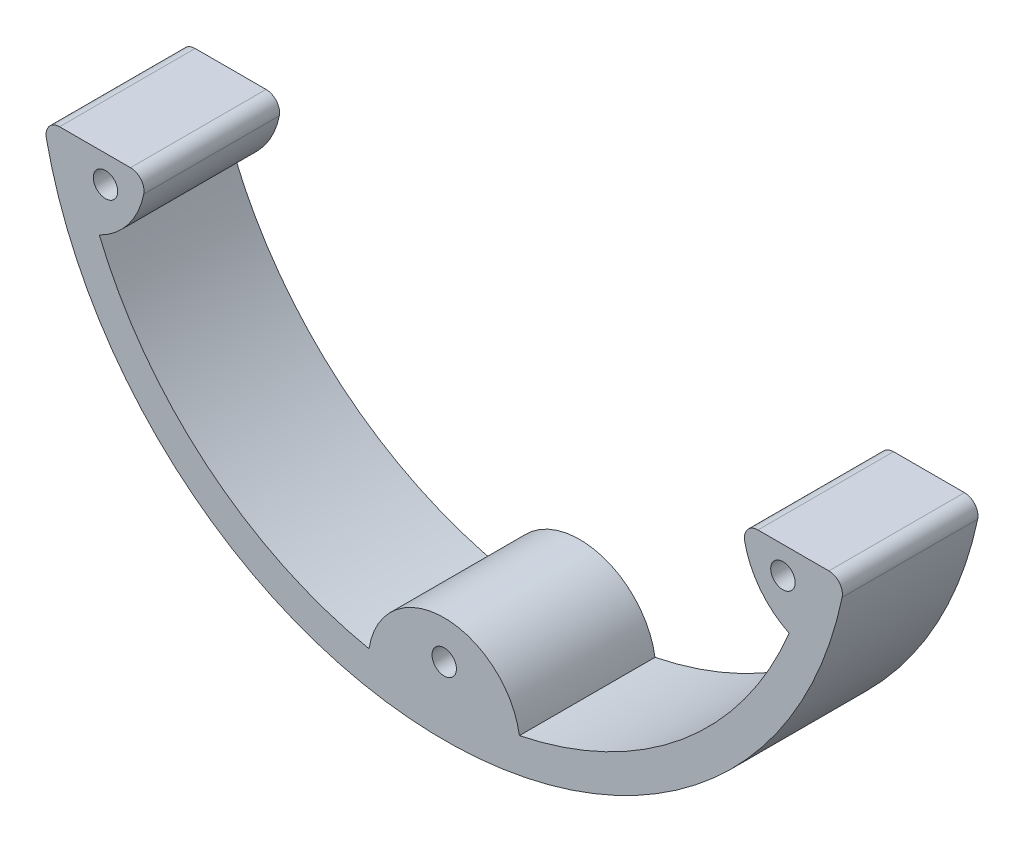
ISO-10303-21;
HEADER;
FILE_DESCRIPTION(('STEP AP214'),'2;1');
FILE_NAME('part.step','',(''),(''),'','','');
FILE_SCHEMA(('AUTOMOTIVE_DESIGN { 1 0 10303 214 1 1 1 1 }'));
ENDSEC;
DATA;
#1=APPLICATION_CONTEXT('core data for automotive mechanical design processes');
#2=APPLICATION_PROTOCOL_DEFINITION('international standard','automotive_design',2000,#1);
#3=PRODUCT_CONTEXT('',#1,'mechanical');
#4=PRODUCT('Part','Part','',(#3));
#5=PRODUCT_RELATED_PRODUCT_CATEGORY('part','',(#4));
#6=PRODUCT_DEFINITION_FORMATION('','',#4);
#7=PRODUCT_DEFINITION_CONTEXT('part definition',#1,'design');
#8=PRODUCT_DEFINITION('design','',#6,#7);
#9=PRODUCT_DEFINITION_SHAPE('','',#8);
#10=(LENGTH_UNIT() NAMED_UNIT(*) SI_UNIT(.MILLI.,.METRE.));
#11=(NAMED_UNIT(*) PLANE_ANGLE_UNIT() SI_UNIT($,.RADIAN.));
#12=(NAMED_UNIT(*) SI_UNIT($,.STERADIAN.) SOLID_ANGLE_UNIT());
#13=UNCERTAINTY_MEASURE_WITH_UNIT(LENGTH_MEASURE(1.E-05),#10,'distance_accuracy_value','');
#14=(GEOMETRIC_REPRESENTATION_CONTEXT(3) GLOBAL_UNCERTAINTY_ASSIGNED_CONTEXT((#13)) GLOBAL_UNIT_ASSIGNED_CONTEXT((#10,
#11,#12)) REPRESENTATION_CONTEXT('',''));
#15=CARTESIAN_POINT('',(0.,0.,0.));
#16=DIRECTION('',(0.,0.,1.));
#17=DIRECTION('',(1.,0.,0.));
#18=AXIS2_PLACEMENT_3D('',#15,#16,#17);
#19=CARTESIAN_POINT('',(0.,0.,120.));
#20=DIRECTION('',(0.,0.,1.));
#21=DIRECTION('',(1.,0.,0.));
#22=AXIS2_PLACEMENT_3D('',#19,#20,#21);
#23=PLANE('',#22);
#24=CARTESIAN_POINT('',(0.164108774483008,-105.,120.));
#25=DIRECTION('',(0.,0.,1.));
#26=DIRECTION('',(1.,0.,0.));
#27=AXIS2_PLACEMENT_3D('',#24,#25,#26);
#28=CIRCLE('',#27,1.8);
#29=CARTESIAN_POINT('',(1.96410877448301,-105.,120.));
#30=VERTEX_POINT('',#29);
#31=EDGE_CURVE('E51',#30,#30,#28,.T.);
#32=ORIENTED_EDGE('',*,*,#31,.T.);
#33=EDGE_LOOP('',(#32));
#34=FACE_BOUND('',#33,.T.);
#35=CARTESIAN_POINT('',(50.1274267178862,-69.,120.));
#36=DIRECTION('',(0.,0.,1.));
#37=DIRECTION('',(1.,0.,0.));
#38=AXIS2_PLACEMENT_3D('',#35,#36,#37);
#39=CIRCLE('',#38,1.8);
#40=CARTESIAN_POINT('',(51.9274267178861,-69.,120.));
#41=VERTEX_POINT('',#40);
#42=EDGE_CURVE('E238',#41,#41,#39,.T.);
#43=ORIENTED_EDGE('',*,*,#42,.T.);
#44=EDGE_LOOP('',(#43));
#45=FACE_BOUND('',#44,.T.);
#46=CARTESIAN_POINT('',(-49.7992091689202,-69.,120.));
#47=DIRECTION('',(0.,0.,1.));
#48=DIRECTION('',(1.,0.,0.));
#49=AXIS2_PLACEMENT_3D('',#46,#47,#48);
#50=CIRCLE('',#49,1.8);
#51=CARTESIAN_POINT('',(-47.9992091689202,-69.,120.));
#52=VERTEX_POINT('',#51);
#53=EDGE_CURVE('E236',#52,#52,#50,.T.);
#54=ORIENTED_EDGE('',*,*,#53,.T.);
#55=EDGE_LOOP('',(#54));
#56=FACE_BOUND('',#55,.T.);
#57=CARTESIAN_POINT('',(0.164108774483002,-55.,120.));
#58=DIRECTION('',(0.,0.,1.));
#59=DIRECTION('',(1.,0.,0.));
#60=AXIS2_PLACEMENT_3D('',#57,#58,#59);
#61=CIRCLE('',#60,60.);
#62=CARTESIAN_POINT('',(58.86587826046,-67.4137931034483,120.));
#63=VERTEX_POINT('',#62);
#64=CARTESIAN_POINT('',(-58.537660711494,-67.4137931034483,120.));
#65=VERTEX_POINT('',#64);
#66=EDGE_CURVE('E234',#63,#65,#61,.F.);
#67=ORIENTED_EDGE('',*,*,#66,.T.);
#68=CARTESIAN_POINT('',(-56.5809350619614,-67.,120.));
#69=DIRECTION('',(0.,0.,1.));
#70=DIRECTION('',(1.,0.,0.));
#71=AXIS2_PLACEMENT_3D('',#68,#69,#70);
#72=CIRCLE('',#71,2.);
#73=CARTESIAN_POINT('',(-56.5809350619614,-65.,120.));
#74=VERTEX_POINT('',#73);
#75=EDGE_CURVE('E72',#65,#74,#72,.F.);
#76=ORIENTED_EDGE('',*,*,#75,.T.);
#77=DIRECTION('',(-1.,0.,0.));
#78=VECTOR('',#77,1.);
#79=CARTESIAN_POINT('',(-58.9966890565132,-65.,120.));
#80=LINE('',#79,#78);
#81=CARTESIAN_POINT('',(-46.1184016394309,-65.,120.));
#82=VERTEX_POINT('',#81);
#83=EDGE_CURVE('E176',#82,#74,#80,.T.);
#84=ORIENTED_EDGE('',*,*,#83,.F.);
#85=CARTESIAN_POINT('',(-46.1184016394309,-67.,120.));
#86=DIRECTION('',(0.,0.,1.));
#87=DIRECTION('',(1.,0.,0.));
#88=AXIS2_PLACEMENT_3D('',#85,#86,#87);
#89=CIRCLE('',#88,2.);
#90=CARTESIAN_POINT('',(-44.1577086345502,-67.3945667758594,120.));
#91=VERTEX_POINT('',#90);
#92=EDGE_CURVE('E56',#82,#91,#89,.F.);
#93=ORIENTED_EDGE('',*,*,#92,.T.);
#94=CARTESIAN_POINT('',(-56.0568613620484,-65.,120.));
#95=DIRECTION('',(0.,0.,1.));
#96=DIRECTION('',(-1.,0.,0.));
#97=AXIS2_PLACEMENT_3D('',#94,#95,#96);
#98=CIRCLE('',#97,12.1377010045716);
#99=CARTESIAN_POINT('',(-50.7113017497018,-75.897191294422,120.));
#100=VERTEX_POINT('',#99);
#101=EDGE_CURVE('E174',#100,#91,#98,.T.);
#102=ORIENTED_EDGE('',*,*,#101,.F.);
#103=CARTESIAN_POINT('',(0.164108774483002,-55.,120.));
#104=DIRECTION('',(0.,0.,-1.));
#105=DIRECTION('',(1.,0.,0.));
#106=AXIS2_PLACEMENT_3D('',#103,#104,#105);
#107=CIRCLE('',#106,55.);
#108=CARTESIAN_POINT('',(-10.9303499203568,-108.869406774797,120.));
#109=VERTEX_POINT('',#108);
#110=EDGE_CURVE('E186',#109,#100,#107,.T.);
#111=ORIENTED_EDGE('',*,*,#110,.F.);
#112=CARTESIAN_POINT('',(0.164108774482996,-110.583326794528,120.));
#113=DIRECTION('',(0.,0.,1.));
#114=DIRECTION('',(-1.,0.,0.));
#115=AXIS2_PLACEMENT_3D('',#112,#113,#114);
#116=CIRCLE('',#115,11.2260650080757);
#117=CARTESIAN_POINT('',(11.2585674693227,-108.869406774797,120.));
#118=VERTEX_POINT('',#117);
#119=EDGE_CURVE('E184',#118,#109,#116,.T.);
#120=ORIENTED_EDGE('',*,*,#119,.F.);
#121=CARTESIAN_POINT('',(0.164108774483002,-55.,120.));
#122=DIRECTION('',(0.,0.,-1.));
#123=DIRECTION('',(1.,0.,0.));
#124=AXIS2_PLACEMENT_3D('',#121,#122,#123);
#125=CIRCLE('',#124,55.);
#126=CARTESIAN_POINT('',(51.0395192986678,-75.897191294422,120.));
#127=VERTEX_POINT('',#126);
#128=EDGE_CURVE('E182',#127,#118,#125,.T.);
#129=ORIENTED_EDGE('',*,*,#128,.F.);
#130=CARTESIAN_POINT('',(56.3850789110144,-65.,120.));
#131=DIRECTION('',(0.,0.,1.));
#132=DIRECTION('',(1.,0.,0.));
#133=AXIS2_PLACEMENT_3D('',#130,#131,#132);
#134=CIRCLE('',#133,12.1377010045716);
#135=CARTESIAN_POINT('',(44.4859261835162,-67.3945667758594,120.));
#136=VERTEX_POINT('',#135);
#137=EDGE_CURVE('E157',#136,#127,#134,.T.);
#138=ORIENTED_EDGE('',*,*,#137,.F.);
#139=CARTESIAN_POINT('',(46.4466191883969,-67.,120.));
#140=DIRECTION('',(0.,0.,1.));
#141=DIRECTION('',(1.,0.,0.));
#142=AXIS2_PLACEMENT_3D('',#139,#140,#141);
#143=CIRCLE('',#142,2.);
#144=CARTESIAN_POINT('',(46.4466191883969,-65.,120.));
#145=VERTEX_POINT('',#144);
#146=EDGE_CURVE('E12',#136,#145,#143,.F.);
#147=ORIENTED_EDGE('',*,*,#146,.T.);
#148=DIRECTION('',(-1.,0.,0.));
#149=VECTOR('',#148,1.);
#150=CARTESIAN_POINT('',(54.2473779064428,-65.,120.));
#151=LINE('',#150,#149);
#152=CARTESIAN_POINT('',(56.9091526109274,-65.,120.));
#153=VERTEX_POINT('',#152);
#154=EDGE_CURVE('E179',#153,#145,#151,.T.);
#155=ORIENTED_EDGE('',*,*,#154,.F.);
#156=CARTESIAN_POINT('',(56.9091526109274,-67.,120.));
#157=DIRECTION('',(0.,0.,1.));
#158=DIRECTION('',(1.,0.,0.));
#159=AXIS2_PLACEMENT_3D('',#156,#157,#158);
#160=CIRCLE('',#159,2.);
#161=EDGE_CURVE('E64',#153,#63,#160,.F.);
#162=ORIENTED_EDGE('',*,*,#161,.T.);
#163=EDGE_LOOP('',(#67,#76,#84,#93,#102,#111,#120,#129,#138,#147,#155,#162));
#164=FACE_BOUND('',#163,.T.);
#165=ADVANCED_FACE('F48',(#34,#45,#56,#164),#23,.F.);
#166=CARTESIAN_POINT('',(0.164108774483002,-55.,140.));
#167=DIRECTION('',(0.,0.,-1.));
#168=DIRECTION('',(-1.,0.,0.));
#169=AXIS2_PLACEMENT_3D('',#166,#167,#168);
#170=CYLINDRICAL_SURFACE('',#169,55.);
#171=ORIENTED_EDGE('',*,*,#128,.T.);
#172=DIRECTION('',(0.,0.,-1.));
#173=VECTOR('',#172,1.);
#174=CARTESIAN_POINT('',(11.2585674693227,-108.869406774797,140.));
#175=LINE('',#174,#173);
#176=CARTESIAN_POINT('',(11.2585674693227,-108.869406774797,140.));
#177=VERTEX_POINT('',#176);
#178=EDGE_CURVE('E161',#177,#118,#175,.T.);
#179=ORIENTED_EDGE('',*,*,#178,.F.);
#180=CARTESIAN_POINT('',(0.164108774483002,-55.,140.));
#181=DIRECTION('',(0.,0.,-1.));
#182=DIRECTION('',(1.,0.,0.));
#183=AXIS2_PLACEMENT_3D('',#180,#181,#182);
#184=CIRCLE('',#183,55.);
#185=CARTESIAN_POINT('',(51.0395192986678,-75.897191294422,140.));
#186=VERTEX_POINT('',#185);
#187=EDGE_CURVE('E144',#186,#177,#184,.T.);
#188=ORIENTED_EDGE('',*,*,#187,.F.);
#189=DIRECTION('',(0.,0.,-1.));
#190=VECTOR('',#189,1.);
#191=CARTESIAN_POINT('',(51.0395192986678,-75.897191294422,140.));
#192=LINE('',#191,#190);
#193=EDGE_CURVE('E154',#186,#127,#192,.T.);
#194=ORIENTED_EDGE('',*,*,#193,.T.);
#195=EDGE_LOOP('',(#171,#179,#188,#194));
#196=FACE_BOUND('',#195,.T.);
#197=ADVANCED_FACE('F163',(#196),#170,.F.);
#198=CARTESIAN_POINT('',(0.164108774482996,-110.583326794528,140.));
#199=DIRECTION('',(0.,0.,-1.));
#200=DIRECTION('',(-1.,0.,0.));
#201=AXIS2_PLACEMENT_3D('',#198,#199,#200);
#202=CYLINDRICAL_SURFACE('',#201,11.2260650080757);
#203=ORIENTED_EDGE('',*,*,#119,.T.);
#204=DIRECTION('',(0.,0.,-1.));
#205=VECTOR('',#204,1.);
#206=CARTESIAN_POINT('',(-10.9303499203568,-108.869406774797,140.));
#207=LINE('',#206,#205);
#208=CARTESIAN_POINT('',(-10.9303499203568,-108.869406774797,140.));
#209=VERTEX_POINT('',#208);
#210=EDGE_CURVE('E191',#209,#109,#207,.T.);
#211=ORIENTED_EDGE('',*,*,#210,.F.);
#212=CARTESIAN_POINT('',(0.164108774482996,-110.583326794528,140.));
#213=DIRECTION('',(0.,0.,1.));
#214=DIRECTION('',(-1.,0.,0.));
#215=AXIS2_PLACEMENT_3D('',#212,#213,#214);
#216=CIRCLE('',#215,11.2260650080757);
#217=EDGE_CURVE('E166',#177,#209,#216,.T.);
#218=ORIENTED_EDGE('',*,*,#217,.F.);
#219=ORIENTED_EDGE('',*,*,#178,.T.);
#220=EDGE_LOOP('',(#203,#211,#218,#219));
#221=FACE_BOUND('',#220,.T.);
#222=ADVANCED_FACE('F273',(#221),#202,.T.);
#223=CARTESIAN_POINT('',(56.3850789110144,-65.,140.));
#224=DIRECTION('',(0.,0.,-1.));
#225=DIRECTION('',(-1.,0.,0.));
#226=AXIS2_PLACEMENT_3D('',#223,#224,#225);
#227=CYLINDRICAL_SURFACE('',#226,12.1377010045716);
#228=CARTESIAN_POINT('',(56.3850789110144,-65.,140.));
#229=DIRECTION('',(0.,0.,1.));
#230=DIRECTION('',(1.,0.,0.));
#231=AXIS2_PLACEMENT_3D('',#228,#229,#230);
#232=CIRCLE('',#231,12.1377010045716);
#233=CARTESIAN_POINT('',(44.4859261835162,-67.3945667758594,140.));
#234=VERTEX_POINT('',#233);
#235=EDGE_CURVE('E139',#234,#186,#232,.T.);
#236=ORIENTED_EDGE('',*,*,#235,.F.);
#237=DIRECTION('',(0.,0.,-1.));
#238=VECTOR('',#237,1.);
#239=CARTESIAN_POINT('',(44.4859261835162,-67.3945667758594,140.));
#240=LINE('',#239,#238);
#241=EDGE_CURVE('E160',#234,#136,#240,.T.);
#242=ORIENTED_EDGE('',*,*,#241,.T.);
#243=ORIENTED_EDGE('',*,*,#137,.T.);
#244=ORIENTED_EDGE('',*,*,#193,.F.);
#245=EDGE_LOOP('',(#236,#242,#243,#244));
#246=FACE_BOUND('',#245,.T.);
#247=ADVANCED_FACE('F155',(#246),#227,.T.);
#248=CARTESIAN_POINT('',(-56.0568613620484,-65.,140.));
#249=DIRECTION('',(0.,0.,-1.));
#250=DIRECTION('',(-1.,0.,0.));
#251=AXIS2_PLACEMENT_3D('',#248,#249,#250);
#252=CYLINDRICAL_SURFACE('',#251,12.1377010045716);
#253=ORIENTED_EDGE('',*,*,#101,.T.);
#254=DIRECTION('',(0.,0.,-1.));
#255=VECTOR('',#254,1.);
#256=CARTESIAN_POINT('',(-44.1577086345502,-67.3945667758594,140.));
#257=LINE('',#256,#255);
#258=CARTESIAN_POINT('',(-44.1577086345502,-67.3945667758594,140.));
#259=VERTEX_POINT('',#258);
#260=EDGE_CURVE('E213',#91,#259,#257,.F.);
#261=ORIENTED_EDGE('',*,*,#260,.T.);
#262=CARTESIAN_POINT('',(-56.0568613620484,-65.,140.));
#263=DIRECTION('',(0.,0.,1.));
#264=DIRECTION('',(-1.,0.,0.));
#265=AXIS2_PLACEMENT_3D('',#262,#263,#264);
#266=CIRCLE('',#265,12.1377010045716);
#267=CARTESIAN_POINT('',(-50.7113017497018,-75.897191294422,140.));
#268=VERTEX_POINT('',#267);
#269=EDGE_CURVE('E188',#268,#259,#266,.T.);
#270=ORIENTED_EDGE('',*,*,#269,.F.);
#271=DIRECTION('',(0.,0.,-1.));
#272=VECTOR('',#271,1.);
#273=CARTESIAN_POINT('',(-50.7113017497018,-75.897191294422,140.));
#274=LINE('',#273,#272);
#275=EDGE_CURVE('E173',#268,#100,#274,.T.);
#276=ORIENTED_EDGE('',*,*,#275,.T.);
#277=EDGE_LOOP('',(#253,#261,#270,#276));
#278=FACE_BOUND('',#277,.T.);
#279=ADVANCED_FACE('F283',(#278),#252,.T.);
#280=CARTESIAN_POINT('',(54.2473779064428,-65.,140.));
#281=DIRECTION('',(0.,-1.,0.));
#282=DIRECTION('',(0.,0.,-1.));
#283=AXIS2_PLACEMENT_3D('',#280,#281,#282);
#284=PLANE('',#283);
#285=DIRECTION('',(-1.,0.,0.));
#286=VECTOR('',#285,1.);
#287=CARTESIAN_POINT('',(54.2473779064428,-65.,140.));
#288=LINE('',#287,#286);
#289=CARTESIAN_POINT('',(56.9091526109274,-65.,140.));
#290=VERTEX_POINT('',#289);
#291=CARTESIAN_POINT('',(46.4466191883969,-65.,140.));
#292=VERTEX_POINT('',#291);
#293=EDGE_CURVE('E151',#290,#292,#288,.T.);
#294=ORIENTED_EDGE('',*,*,#293,.F.);
#295=DIRECTION('',(0.,0.,-1.));
#296=VECTOR('',#295,1.);
#297=CARTESIAN_POINT('',(56.9091526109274,-65.,120.));
#298=LINE('',#297,#296);
#299=EDGE_CURVE('E214',#290,#153,#298,.T.);
#300=ORIENTED_EDGE('',*,*,#299,.T.);
#301=ORIENTED_EDGE('',*,*,#154,.T.);
#302=DIRECTION('',(0.,0.,-1.));
#303=VECTOR('',#302,1.);
#304=CARTESIAN_POINT('',(46.4466191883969,-65.,140.));
#305=LINE('',#304,#303);
#306=EDGE_CURVE('E204',#145,#292,#305,.F.);
#307=ORIENTED_EDGE('',*,*,#306,.T.);
#308=EDGE_LOOP('',(#294,#300,#301,#307));
#309=FACE_BOUND('',#308,.T.);
#310=ADVANCED_FACE('F284',(#309),#284,.F.);
#311=CARTESIAN_POINT('',(0.164108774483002,-55.,110.));
#312=DIRECTION('',(0.,0.,1.));
#313=DIRECTION('',(1.,0.,0.));
#314=AXIS2_PLACEMENT_3D('',#311,#312,#313);
#315=CYLINDRICAL_SURFACE('',#314,60.);
#316=ORIENTED_EDGE('',*,*,#66,.F.);
#317=DIRECTION('',(0.,0.,1.));
#318=VECTOR('',#317,1.);
#319=CARTESIAN_POINT('',(58.86587826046,-67.4137931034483,110.));
#320=LINE('',#319,#318);
#321=CARTESIAN_POINT('',(58.86587826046,-67.4137931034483,140.));
#322=VERTEX_POINT('',#321);
#323=EDGE_CURVE('E220',#63,#322,#320,.T.);
#324=ORIENTED_EDGE('',*,*,#323,.T.);
#325=CARTESIAN_POINT('',(0.164108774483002,-55.,140.));
#326=DIRECTION('',(0.,0.,1.));
#327=DIRECTION('',(1.,0.,0.));
#328=AXIS2_PLACEMENT_3D('',#325,#326,#327);
#329=CIRCLE('',#328,60.);
#330=CARTESIAN_POINT('',(-58.537660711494,-67.4137931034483,140.));
#331=VERTEX_POINT('',#330);
#332=EDGE_CURVE('E312',#331,#322,#329,.T.);
#333=ORIENTED_EDGE('',*,*,#332,.F.);
#334=DIRECTION('',(0.,0.,1.));
#335=VECTOR('',#334,1.);
#336=CARTESIAN_POINT('',(-58.537660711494,-67.4137931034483,110.));
#337=LINE('',#336,#335);
#338=EDGE_CURVE('E225',#331,#65,#337,.F.);
#339=ORIENTED_EDGE('',*,*,#338,.T.);
#340=EDGE_LOOP('',(#316,#324,#333,#339));
#341=FACE_BOUND('',#340,.T.);
#342=ADVANCED_FACE('F263',(#341),#315,.T.);
#343=CARTESIAN_POINT('',(-58.9966890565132,-65.,140.));
#344=DIRECTION('',(0.,-1.,0.));
#345=DIRECTION('',(0.,0.,-1.));
#346=AXIS2_PLACEMENT_3D('',#343,#344,#345);
#347=PLANE('',#346);
#348=ORIENTED_EDGE('',*,*,#83,.T.);
#349=DIRECTION('',(0.,0.,-1.));
#350=VECTOR('',#349,1.);
#351=CARTESIAN_POINT('',(-56.5809350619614,-65.,140.));
#352=LINE('',#351,#350);
#353=CARTESIAN_POINT('',(-56.5809350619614,-65.,140.));
#354=VERTEX_POINT('',#353);
#355=EDGE_CURVE('E229',#74,#354,#352,.F.);
#356=ORIENTED_EDGE('',*,*,#355,.T.);
#357=DIRECTION('',(-1.,0.,0.));
#358=VECTOR('',#357,1.);
#359=CARTESIAN_POINT('',(-53.9191603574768,-65.,140.));
#360=LINE('',#359,#358);
#361=CARTESIAN_POINT('',(-46.1184016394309,-65.,140.));
#362=VERTEX_POINT('',#361);
#363=EDGE_CURVE('E314',#362,#354,#360,.T.);
#364=ORIENTED_EDGE('',*,*,#363,.F.);
#365=DIRECTION('',(0.,0.,-1.));
#366=VECTOR('',#365,1.);
#367=CARTESIAN_POINT('',(-46.1184016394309,-65.,140.));
#368=LINE('',#367,#366);
#369=EDGE_CURVE('E210',#362,#82,#368,.T.);
#370=ORIENTED_EDGE('',*,*,#369,.T.);
#371=EDGE_LOOP('',(#348,#356,#364,#370));
#372=FACE_BOUND('',#371,.T.);
#373=ADVANCED_FACE('F255',(#372),#347,.F.);
#374=CARTESIAN_POINT('',(-56.0568613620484,-65.,140.));
#375=DIRECTION('',(0.,0.,-1.));
#376=DIRECTION('',(-1.,0.,0.));
#377=AXIS2_PLACEMENT_3D('',#374,#375,#376);
#378=PLANE('',#377);
#379=CARTESIAN_POINT('',(-49.7992091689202,-69.,140.));
#380=DIRECTION('',(0.,0.,-1.));
#381=DIRECTION('',(-1.,0.,0.));
#382=AXIS2_PLACEMENT_3D('',#379,#380,#381);
#383=CIRCLE('',#382,1.8);
#384=CARTESIAN_POINT('',(-51.5992091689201,-69.,140.));
#385=VERTEX_POINT('',#384);
#386=EDGE_CURVE('E177',#385,#385,#383,.F.);
#387=ORIENTED_EDGE('',*,*,#386,.F.);
#388=EDGE_LOOP('',(#387));
#389=FACE_BOUND('',#388,.T.);
#390=CARTESIAN_POINT('',(50.1274267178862,-69.,140.));
#391=DIRECTION('',(0.,0.,-1.));
#392=DIRECTION('',(-1.,0.,0.));
#393=AXIS2_PLACEMENT_3D('',#390,#391,#392);
#394=CIRCLE('',#393,1.8);
#395=CARTESIAN_POINT('',(48.3274267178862,-69.,140.));
#396=VERTEX_POINT('',#395);
#397=EDGE_CURVE('E198',#396,#396,#394,.F.);
#398=ORIENTED_EDGE('',*,*,#397,.F.);
#399=EDGE_LOOP('',(#398));
#400=FACE_BOUND('',#399,.T.);
#401=CARTESIAN_POINT('',(0.164108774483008,-105.,140.));
#402=DIRECTION('',(0.,0.,-1.));
#403=DIRECTION('',(-1.,0.,0.));
#404=AXIS2_PLACEMENT_3D('',#401,#402,#403);
#405=CIRCLE('',#404,1.8);
#406=CARTESIAN_POINT('',(-1.63589122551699,-105.,140.));
#407=VERTEX_POINT('',#406);
#408=EDGE_CURVE('E195',#407,#407,#405,.F.);
#409=ORIENTED_EDGE('',*,*,#408,.F.);
#410=EDGE_LOOP('',(#409));
#411=FACE_BOUND('',#410,.T.);
#412=ORIENTED_EDGE('',*,*,#363,.T.);
#413=CARTESIAN_POINT('',(-56.5809350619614,-67.,140.));
#414=DIRECTION('',(0.,0.,-1.));
#415=DIRECTION('',(-1.,0.,0.));
#416=AXIS2_PLACEMENT_3D('',#413,#414,#415);
#417=CIRCLE('',#416,2.);
#418=EDGE_CURVE('E231',#354,#331,#417,.F.);
#419=ORIENTED_EDGE('',*,*,#418,.T.);
#420=ORIENTED_EDGE('',*,*,#332,.T.);
#421=CARTESIAN_POINT('',(56.9091526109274,-67.,140.));
#422=DIRECTION('',(0.,0.,-1.));
#423=DIRECTION('',(-1.,0.,0.));
#424=AXIS2_PLACEMENT_3D('',#421,#422,#423);
#425=CIRCLE('',#424,2.);
#426=EDGE_CURVE('E223',#322,#290,#425,.F.);
#427=ORIENTED_EDGE('',*,*,#426,.T.);
#428=ORIENTED_EDGE('',*,*,#293,.T.);
#429=CARTESIAN_POINT('',(46.4466191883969,-67.,140.));
#430=DIRECTION('',(0.,0.,-1.));
#431=DIRECTION('',(-1.,0.,0.));
#432=AXIS2_PLACEMENT_3D('',#429,#430,#431);
#433=CIRCLE('',#432,2.);
#434=EDGE_CURVE('E147',#292,#234,#433,.F.);
#435=ORIENTED_EDGE('',*,*,#434,.T.);
#436=ORIENTED_EDGE('',*,*,#235,.T.);
#437=ORIENTED_EDGE('',*,*,#187,.T.);
#438=ORIENTED_EDGE('',*,*,#217,.T.);
#439=CARTESIAN_POINT('',(0.164108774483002,-55.,140.));
#440=DIRECTION('',(0.,0.,-1.));
#441=DIRECTION('',(1.,0.,0.));
#442=AXIS2_PLACEMENT_3D('',#439,#440,#441);
#443=CIRCLE('',#442,55.);
#444=EDGE_CURVE('E168',#209,#268,#443,.T.);
#445=ORIENTED_EDGE('',*,*,#444,.T.);
#446=ORIENTED_EDGE('',*,*,#269,.T.);
#447=CARTESIAN_POINT('',(-46.1184016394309,-67.,140.));
#448=DIRECTION('',(0.,0.,-1.));
#449=DIRECTION('',(-1.,0.,0.));
#450=AXIS2_PLACEMENT_3D('',#447,#448,#449);
#451=CIRCLE('',#450,2.);
#452=EDGE_CURVE('E207',#259,#362,#451,.F.);
#453=ORIENTED_EDGE('',*,*,#452,.T.);
#454=EDGE_LOOP('',(#412,#419,#420,#427,#428,#435,#436,#437,#438,#445,#446,#453));
#455=FACE_BOUND('',#454,.T.);
#456=ADVANCED_FACE('F142',(#389,#400,#411,#455),#378,.F.);
#457=CARTESIAN_POINT('',(-56.5809350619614,-67.,110.));
#458=DIRECTION('',(0.,0.,1.));
#459=DIRECTION('',(1.,0.,0.));
#460=AXIS2_PLACEMENT_3D('',#457,#458,#459);
#461=CYLINDRICAL_SURFACE('',#460,2.);
#462=ORIENTED_EDGE('',*,*,#418,.F.);
#463=ORIENTED_EDGE('',*,*,#355,.F.);
#464=ORIENTED_EDGE('',*,*,#75,.F.);
#465=ORIENTED_EDGE('',*,*,#338,.F.);
#466=EDGE_LOOP('',(#462,#463,#464,#465));
#467=FACE_BOUND('',#466,.T.);
#468=ADVANCED_FACE('F254',(#467),#461,.T.);
#469=CARTESIAN_POINT('',(56.9091526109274,-67.,110.));
#470=DIRECTION('',(0.,0.,1.));
#471=DIRECTION('',(1.,0.,0.));
#472=AXIS2_PLACEMENT_3D('',#469,#470,#471);
#473=CYLINDRICAL_SURFACE('',#472,2.);
#474=ORIENTED_EDGE('',*,*,#426,.F.);
#475=ORIENTED_EDGE('',*,*,#323,.F.);
#476=ORIENTED_EDGE('',*,*,#161,.F.);
#477=ORIENTED_EDGE('',*,*,#299,.F.);
#478=EDGE_LOOP('',(#474,#475,#476,#477));
#479=FACE_BOUND('',#478,.T.);
#480=ADVANCED_FACE('F262',(#479),#473,.T.);
#481=CARTESIAN_POINT('',(-46.1184016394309,-67.,140.));
#482=DIRECTION('',(0.,0.,-1.));
#483=DIRECTION('',(-1.,0.,0.));
#484=AXIS2_PLACEMENT_3D('',#481,#482,#483);
#485=CYLINDRICAL_SURFACE('',#484,2.);
#486=ORIENTED_EDGE('',*,*,#452,.F.);
#487=ORIENTED_EDGE('',*,*,#260,.F.);
#488=ORIENTED_EDGE('',*,*,#92,.F.);
#489=ORIENTED_EDGE('',*,*,#369,.F.);
#490=EDGE_LOOP('',(#486,#487,#488,#489));
#491=FACE_BOUND('',#490,.T.);
#492=ADVANCED_FACE('F298',(#491),#485,.T.);
#493=CARTESIAN_POINT('',(46.4466191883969,-67.,140.));
#494=DIRECTION('',(0.,0.,-1.));
#495=DIRECTION('',(-1.,0.,0.));
#496=AXIS2_PLACEMENT_3D('',#493,#494,#495);
#497=CYLINDRICAL_SURFACE('',#496,2.);
#498=ORIENTED_EDGE('',*,*,#434,.F.);
#499=ORIENTED_EDGE('',*,*,#306,.F.);
#500=ORIENTED_EDGE('',*,*,#146,.F.);
#501=ORIENTED_EDGE('',*,*,#241,.F.);
#502=EDGE_LOOP('',(#498,#499,#500,#501));
#503=FACE_BOUND('',#502,.T.);
#504=ADVANCED_FACE('F294',(#503),#497,.T.);
#505=CARTESIAN_POINT('',(0.164108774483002,-55.,140.));
#506=DIRECTION('',(0.,0.,-1.));
#507=DIRECTION('',(-1.,0.,0.));
#508=AXIS2_PLACEMENT_3D('',#505,#506,#507);
#509=CYLINDRICAL_SURFACE('',#508,55.);
#510=ORIENTED_EDGE('',*,*,#110,.T.);
#511=ORIENTED_EDGE('',*,*,#275,.F.);
#512=ORIENTED_EDGE('',*,*,#444,.F.);
#513=ORIENTED_EDGE('',*,*,#210,.T.);
#514=EDGE_LOOP('',(#510,#511,#512,#513));
#515=FACE_BOUND('',#514,.T.);
#516=ADVANCED_FACE('F297',(#515),#509,.F.);
#517=CARTESIAN_POINT('',(-49.7992091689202,-69.,156.));
#518=DIRECTION('',(0.,0.,-1.));
#519=DIRECTION('',(-1.,0.,0.));
#520=AXIS2_PLACEMENT_3D('',#517,#518,#519);
#521=CYLINDRICAL_SURFACE('',#520,1.8);
#522=ORIENTED_EDGE('',*,*,#53,.F.);
#523=EDGE_LOOP('',(#522));
#524=FACE_BOUND('',#523,.T.);
#525=ORIENTED_EDGE('',*,*,#386,.T.);
#526=EDGE_LOOP('',(#525));
#527=FACE_BOUND('',#526,.T.);
#528=ADVANCED_FACE('F334',(#524,#527),#521,.F.);
#529=CARTESIAN_POINT('',(50.1274267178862,-69.,156.));
#530=DIRECTION('',(0.,0.,-1.));
#531=DIRECTION('',(-1.,0.,0.));
#532=AXIS2_PLACEMENT_3D('',#529,#530,#531);
#533=CYLINDRICAL_SURFACE('',#532,1.8);
#534=ORIENTED_EDGE('',*,*,#42,.F.);
#535=EDGE_LOOP('',(#534));
#536=FACE_BOUND('',#535,.T.);
#537=ORIENTED_EDGE('',*,*,#397,.T.);
#538=EDGE_LOOP('',(#537));
#539=FACE_BOUND('',#538,.T.);
#540=ADVANCED_FACE('F249',(#536,#539),#533,.F.);
#541=CARTESIAN_POINT('',(0.164108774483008,-105.,156.));
#542=DIRECTION('',(0.,0.,-1.));
#543=DIRECTION('',(-1.,0.,0.));
#544=AXIS2_PLACEMENT_3D('',#541,#542,#543);
#545=CYLINDRICAL_SURFACE('',#544,1.8);
#546=ORIENTED_EDGE('',*,*,#31,.F.);
#547=EDGE_LOOP('',(#546));
#548=FACE_BOUND('',#547,.T.);
#549=ORIENTED_EDGE('',*,*,#408,.T.);
#550=EDGE_LOOP('',(#549));
#551=FACE_BOUND('',#550,.T.);
#552=ADVANCED_FACE('F246',(#548,#551),#545,.F.);
#553=CLOSED_SHELL('',(#165,#197,#222,#247,#279,#310,#342,#373,#456,#468,#480,#492,#504,#516,
#528,#540,#552));
#554=MANIFOLD_SOLID_BREP('B2',#553);
#555=ADVANCED_BREP_SHAPE_REPRESENTATION('',(#18,#554),#14);
#556=SHAPE_DEFINITION_REPRESENTATION(#9,#555);
ENDSEC;
END-ISO-10303-21;
